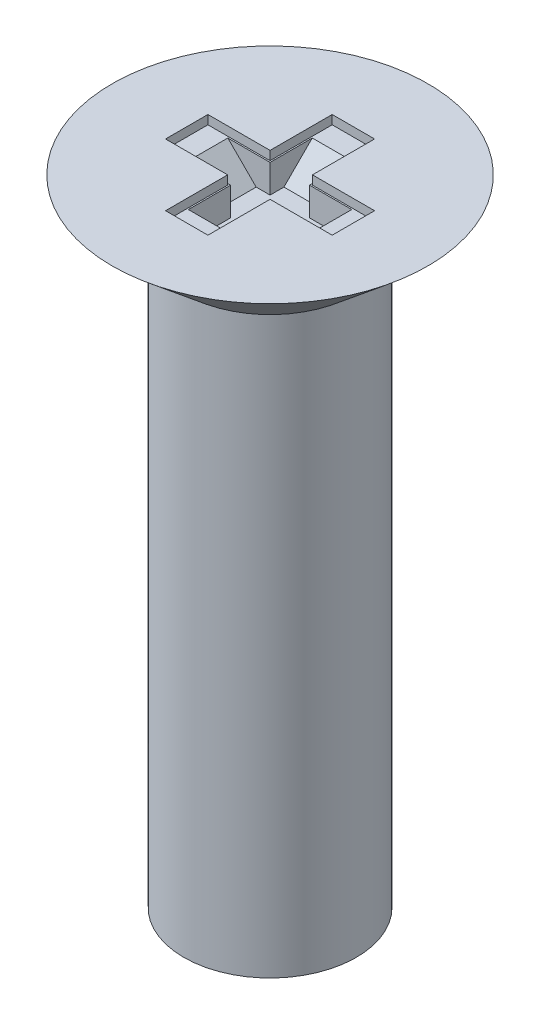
ISO-10303-21;
HEADER;
FILE_DESCRIPTION(('STEP AP214'),'2;1');
FILE_NAME('part.step','',(''),(''),'','','');
FILE_SCHEMA(('AUTOMOTIVE_DESIGN { 1 0 10303 214 1 1 1 1 }'));
ENDSEC;
DATA;
#1=APPLICATION_CONTEXT('core data for automotive mechanical design processes');
#2=APPLICATION_PROTOCOL_DEFINITION('international standard','automotive_design',2000,#1);
#3=PRODUCT_CONTEXT('',#1,'mechanical');
#4=PRODUCT('Part','Part','',(#3));
#5=PRODUCT_RELATED_PRODUCT_CATEGORY('part','',(#4));
#6=PRODUCT_DEFINITION_FORMATION('','',#4);
#7=PRODUCT_DEFINITION_CONTEXT('part definition',#1,'design');
#8=PRODUCT_DEFINITION('design','',#6,#7);
#9=PRODUCT_DEFINITION_SHAPE('','',#8);
#10=(LENGTH_UNIT() NAMED_UNIT(*) SI_UNIT(.MILLI.,.METRE.));
#11=(NAMED_UNIT(*) PLANE_ANGLE_UNIT() SI_UNIT($,.RADIAN.));
#12=(NAMED_UNIT(*) SI_UNIT($,.STERADIAN.) SOLID_ANGLE_UNIT());
#13=UNCERTAINTY_MEASURE_WITH_UNIT(LENGTH_MEASURE(1.E-05),#10,'distance_accuracy_value','');
#14=(GEOMETRIC_REPRESENTATION_CONTEXT(3) GLOBAL_UNCERTAINTY_ASSIGNED_CONTEXT((#13)) GLOBAL_UNIT_ASSIGNED_CONTEXT((#10,
#11,#12)) REPRESENTATION_CONTEXT('',''));
#15=CARTESIAN_POINT('',(0.,0.,0.));
#16=DIRECTION('',(0.,0.,1.));
#17=DIRECTION('',(1.,0.,0.));
#18=AXIS2_PLACEMENT_3D('',#15,#16,#17);
#19=CARTESIAN_POINT('',(-0.58416716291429,0.396610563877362,-0.3429));
#20=DIRECTION('',(0.,-1.,0.));
#21=DIRECTION('',(0.,0.,-1.));
#22=AXIS2_PLACEMENT_3D('',#19,#20,#21);
#23=PLANE('',#22);
#24=DIRECTION('',(1.,0.,0.));
#25=VECTOR('',#24,1.);
#26=CARTESIAN_POINT('',(-0.58416716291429,0.396610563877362,0.3429));
#27=LINE('',#26,#25);
#28=CARTESIAN_POINT('',(-0.584167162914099,0.396610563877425,0.3429));
#29=VERTEX_POINT('',#28);
#30=CARTESIAN_POINT('',(-0.3429,0.396610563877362,0.3429));
#31=VERTEX_POINT('',#30);
#32=EDGE_CURVE('E181',#29,#31,#27,.T.);
#33=ORIENTED_EDGE('',*,*,#32,.T.);
#34=DIRECTION('',(0.,0.,-1.));
#35=VECTOR('',#34,1.);
#36=CARTESIAN_POINT('',(-0.3429,0.396610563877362,0.));
#37=LINE('',#36,#35);
#38=CARTESIAN_POINT('',(-0.3429,0.396610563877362,0.584167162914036));
#39=VERTEX_POINT('',#38);
#40=EDGE_CURVE('E19',#39,#31,#37,.T.);
#41=ORIENTED_EDGE('',*,*,#40,.F.);
#42=DIRECTION('',(1.,0.,0.));
#43=VECTOR('',#42,1.);
#44=CARTESIAN_POINT('',(-0.3429,0.396610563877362,0.584167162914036));
#45=LINE('',#44,#43);
#46=CARTESIAN_POINT('',(0.3429,0.396610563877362,0.584167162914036));
#47=VERTEX_POINT('',#46);
#48=EDGE_CURVE('E178',#39,#47,#45,.T.);
#49=ORIENTED_EDGE('',*,*,#48,.T.);
#50=DIRECTION('',(0.,0.,-1.));
#51=VECTOR('',#50,1.);
#52=CARTESIAN_POINT('',(0.3429,0.396610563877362,-0.3429));
#53=LINE('',#52,#51);
#54=CARTESIAN_POINT('',(0.3429,0.396610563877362,0.3429));
#55=VERTEX_POINT('',#54);
#56=EDGE_CURVE('E193',#47,#55,#53,.T.);
#57=ORIENTED_EDGE('',*,*,#56,.T.);
#58=DIRECTION('',(1.,0.,0.));
#59=VECTOR('',#58,1.);
#60=CARTESIAN_POINT('',(-0.58416716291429,0.396610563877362,0.3429));
#61=LINE('',#60,#59);
#62=CARTESIAN_POINT('',(0.58416716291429,0.396610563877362,0.3429));
#63=VERTEX_POINT('',#62);
#64=EDGE_CURVE('E204',#55,#63,#61,.T.);
#65=ORIENTED_EDGE('',*,*,#64,.T.);
#66=DIRECTION('',(0.,0.,1.));
#67=VECTOR('',#66,1.);
#68=CARTESIAN_POINT('',(0.58416716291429,0.396610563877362,-0.3429));
#69=LINE('',#68,#67);
#70=CARTESIAN_POINT('',(0.58416716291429,0.396610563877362,-0.3429));
#71=VERTEX_POINT('',#70);
#72=EDGE_CURVE('E207',#63,#71,#69,.F.);
#73=ORIENTED_EDGE('',*,*,#72,.T.);
#74=DIRECTION('',(1.,0.,0.));
#75=VECTOR('',#74,1.);
#76=CARTESIAN_POINT('',(0.,0.396610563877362,-0.3429));
#77=LINE('',#76,#75);
#78=CARTESIAN_POINT('',(0.3429,0.396610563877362,-0.3429));
#79=VERTEX_POINT('',#78);
#80=EDGE_CURVE('E208',#79,#71,#77,.T.);
#81=ORIENTED_EDGE('',*,*,#80,.F.);
#82=DIRECTION('',(0.,0.,-1.));
#83=VECTOR('',#82,1.);
#84=CARTESIAN_POINT('',(0.3429,0.396610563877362,-0.3429));
#85=LINE('',#84,#83);
#86=CARTESIAN_POINT('',(0.3429,0.396610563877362,-0.584167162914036));
#87=VERTEX_POINT('',#86);
#88=EDGE_CURVE('E213',#79,#87,#85,.T.);
#89=ORIENTED_EDGE('',*,*,#88,.T.);
#90=DIRECTION('',(-1.,0.,0.));
#91=VECTOR('',#90,1.);
#92=CARTESIAN_POINT('',(-0.3429,0.396610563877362,-0.584167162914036));
#93=LINE('',#92,#91);
#94=CARTESIAN_POINT('',(-0.3429,0.396610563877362,-0.584167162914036));
#95=VERTEX_POINT('',#94);
#96=EDGE_CURVE('E215',#87,#95,#93,.T.);
#97=ORIENTED_EDGE('',*,*,#96,.T.);
#98=DIRECTION('',(0.,0.,-1.));
#99=VECTOR('',#98,1.);
#100=CARTESIAN_POINT('',(-0.3429,0.396610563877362,0.));
#101=LINE('',#100,#99);
#102=CARTESIAN_POINT('',(-0.3429,0.396610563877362,-0.3429));
#103=VERTEX_POINT('',#102);
#104=EDGE_CURVE('E221',#103,#95,#101,.T.);
#105=ORIENTED_EDGE('',*,*,#104,.F.);
#106=DIRECTION('',(1.,0.,0.));
#107=VECTOR('',#106,1.);
#108=CARTESIAN_POINT('',(0.,0.396610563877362,-0.3429));
#109=LINE('',#108,#107);
#110=CARTESIAN_POINT('',(-0.584167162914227,0.396610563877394,-0.3429));
#111=VERTEX_POINT('',#110);
#112=EDGE_CURVE('E223',#111,#103,#109,.T.);
#113=ORIENTED_EDGE('',*,*,#112,.F.);
#114=DIRECTION('',(0.,0.,1.));
#115=VECTOR('',#114,1.);
#116=CARTESIAN_POINT('',(-0.584167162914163,0.396610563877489,-0.3429));
#117=LINE('',#116,#115);
#118=EDGE_CURVE('E226',#111,#29,#117,.T.);
#119=ORIENTED_EDGE('',*,*,#118,.T.);
#120=EDGE_LOOP('',(#33,#41,#49,#57,#65,#73,#81,#89,#97,#105,#113,#119));
#121=FACE_BOUND('',#120,.T.);
#122=ADVANCED_FACE('F16',(#121),#23,.F.);
#123=CARTESIAN_POINT('',(-0.3429,0.,0.));
#124=DIRECTION('',(1.,0.,0.));
#125=DIRECTION('',(0.,0.,-1.));
#126=AXIS2_PLACEMENT_3D('',#123,#124,#125);
#127=PLANE('',#126);
#128=ORIENTED_EDGE('',*,*,#40,.T.);
#129=DIRECTION('',(0.,1.,0.));
#130=VECTOR('',#129,1.);
#131=CARTESIAN_POINT('',(-0.3429,0.,0.3429));
#132=LINE('',#131,#130);
#133=CARTESIAN_POINT('',(-0.3429,0.889,0.3429));
#134=VERTEX_POINT('',#133);
#135=EDGE_CURVE('E184',#31,#134,#132,.T.);
#136=ORIENTED_EDGE('',*,*,#135,.T.);
#137=DIRECTION('',(0.,0.,1.));
#138=VECTOR('',#137,1.);
#139=CARTESIAN_POINT('',(-0.3429,0.889,0.));
#140=LINE('',#139,#138);
#141=CARTESIAN_POINT('',(-0.3429,0.889,1.07655659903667));
#142=VERTEX_POINT('',#141);
#143=EDGE_CURVE('E189',#142,#134,#140,.F.);
#144=ORIENTED_EDGE('',*,*,#143,.F.);
#145=DIRECTION('',(0.,-0.707106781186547,-0.707106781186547));
#146=VECTOR('',#145,1.);
#147=CARTESIAN_POINT('',(-0.3429,0.889,1.07655659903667));
#148=LINE('',#147,#146);
#149=EDGE_CURVE('E186',#142,#39,#148,.T.);
#150=ORIENTED_EDGE('',*,*,#149,.T.);
#151=EDGE_LOOP('',(#128,#136,#144,#150));
#152=FACE_BOUND('',#151,.T.);
#153=ADVANCED_FACE('F187',(#152),#127,.T.);
#154=CARTESIAN_POINT('',(0.,0.,0.3429));
#155=DIRECTION('',(0.,0.,1.));
#156=DIRECTION('',(1.,0.,0.));
#157=AXIS2_PLACEMENT_3D('',#154,#155,#156);
#158=PLANE('',#157);
#159=DIRECTION('',(0.707106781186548,-0.707106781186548,0.));
#160=VECTOR('',#159,1.);
#161=CARTESIAN_POINT('',(-1.2319,1.04434340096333,0.3429));
#162=LINE('',#161,#160);
#163=CARTESIAN_POINT('',(-1.07655659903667,0.889,0.3429));
#164=VERTEX_POINT('',#163);
#165=EDGE_CURVE('E227',#29,#164,#162,.F.);
#166=ORIENTED_EDGE('',*,*,#165,.T.);
#167=DIRECTION('',(1.,0.,0.));
#168=VECTOR('',#167,1.);
#169=CARTESIAN_POINT('',(0.,0.889,0.3429));
#170=LINE('',#169,#168);
#171=EDGE_CURVE('E236',#134,#164,#170,.F.);
#172=ORIENTED_EDGE('',*,*,#171,.F.);
#173=ORIENTED_EDGE('',*,*,#135,.F.);
#174=ORIENTED_EDGE('',*,*,#32,.F.);
#175=EDGE_LOOP('',(#166,#172,#173,#174));
#176=FACE_BOUND('',#175,.T.);
#177=ADVANCED_FACE('F433',(#176),#158,.F.);
#178=CARTESIAN_POINT('',(-1.2319,1.04434340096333,-0.3429));
#179=DIRECTION('',(-0.707106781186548,-0.707106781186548,0.));
#180=DIRECTION('',(0.707106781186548,-0.707106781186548,0.));
#181=AXIS2_PLACEMENT_3D('',#178,#179,#180);
#182=PLANE('',#181);
#183=ORIENTED_EDGE('',*,*,#165,.F.);
#184=ORIENTED_EDGE('',*,*,#118,.F.);
#185=DIRECTION('',(0.707106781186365,-0.70710678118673,0.));
#186=VECTOR('',#185,1.);
#187=CARTESIAN_POINT('',(-1.07655659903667,0.889,-0.3429));
#188=LINE('',#187,#186);
#189=CARTESIAN_POINT('',(-1.07655659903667,0.889,-0.3429));
#190=VERTEX_POINT('',#189);
#191=EDGE_CURVE('E225',#190,#111,#188,.T.);
#192=ORIENTED_EDGE('',*,*,#191,.F.);
#193=DIRECTION('',(0.,0.,1.));
#194=VECTOR('',#193,1.);
#195=CARTESIAN_POINT('',(-1.07655659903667,0.889,0.));
#196=LINE('',#195,#194);
#197=EDGE_CURVE('E239',#164,#190,#196,.F.);
#198=ORIENTED_EDGE('',*,*,#197,.F.);
#199=EDGE_LOOP('',(#183,#184,#192,#198));
#200=FACE_BOUND('',#199,.T.);
#201=ADVANCED_FACE('F399',(#200),#182,.F.);
#202=CARTESIAN_POINT('',(0.,0.,-0.3429));
#203=DIRECTION('',(0.,0.,1.));
#204=DIRECTION('',(1.,0.,0.));
#205=AXIS2_PLACEMENT_3D('',#202,#203,#204);
#206=PLANE('',#205);
#207=ORIENTED_EDGE('',*,*,#112,.T.);
#208=DIRECTION('',(0.,1.,0.));
#209=VECTOR('',#208,1.);
#210=CARTESIAN_POINT('',(-0.3429,0.,-0.3429));
#211=LINE('',#210,#209);
#212=CARTESIAN_POINT('',(-0.3429,0.889,-0.3429));
#213=VERTEX_POINT('',#212);
#214=EDGE_CURVE('E220',#213,#103,#211,.F.);
#215=ORIENTED_EDGE('',*,*,#214,.F.);
#216=DIRECTION('',(1.,0.,0.));
#217=VECTOR('',#216,1.);
#218=CARTESIAN_POINT('',(0.,0.889,-0.3429));
#219=LINE('',#218,#217);
#220=EDGE_CURVE('E379',#190,#213,#219,.T.);
#221=ORIENTED_EDGE('',*,*,#220,.F.);
#222=ORIENTED_EDGE('',*,*,#191,.T.);
#223=EDGE_LOOP('',(#207,#215,#221,#222));
#224=FACE_BOUND('',#223,.T.);
#225=ADVANCED_FACE('F402',(#224),#206,.T.);
#226=CARTESIAN_POINT('',(-0.3429,0.,0.));
#227=DIRECTION('',(1.,0.,0.));
#228=DIRECTION('',(0.,0.,-1.));
#229=AXIS2_PLACEMENT_3D('',#226,#227,#228);
#230=PLANE('',#229);
#231=DIRECTION('',(0.,0.,1.));
#232=VECTOR('',#231,1.);
#233=CARTESIAN_POINT('',(-0.3429,0.889,0.));
#234=LINE('',#233,#232);
#235=CARTESIAN_POINT('',(-0.3429,0.889,-1.07655659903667));
#236=VERTEX_POINT('',#235);
#237=EDGE_CURVE('E376',#213,#236,#234,.F.);
#238=ORIENTED_EDGE('',*,*,#237,.F.);
#239=ORIENTED_EDGE('',*,*,#214,.T.);
#240=ORIENTED_EDGE('',*,*,#104,.T.);
#241=DIRECTION('',(0.,0.707106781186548,-0.707106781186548));
#242=VECTOR('',#241,1.);
#243=CARTESIAN_POINT('',(-0.3429,0.396637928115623,-0.584194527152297));
#244=LINE('',#243,#242);
#245=EDGE_CURVE('E218',#95,#236,#244,.T.);
#246=ORIENTED_EDGE('',*,*,#245,.T.);
#247=EDGE_LOOP('',(#238,#239,#240,#246));
#248=FACE_BOUND('',#247,.T.);
#249=ADVANCED_FACE('F405',(#248),#230,.T.);
#250=CARTESIAN_POINT('',(-0.3429,0.396643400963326,-0.5842));
#251=DIRECTION('',(0.,-0.707106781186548,-0.707106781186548));
#252=DIRECTION('',(0.,0.707106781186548,-0.707106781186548));
#253=AXIS2_PLACEMENT_3D('',#250,#251,#252);
#254=PLANE('',#253);
#255=DIRECTION('',(0.,0.707106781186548,-0.707106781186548));
#256=VECTOR('',#255,1.);
#257=CARTESIAN_POINT('',(0.3429,0.396643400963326,-0.5842));
#258=LINE('',#257,#256);
#259=CARTESIAN_POINT('',(0.3429,0.889,-1.07655659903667));
#260=VERTEX_POINT('',#259);
#261=EDGE_CURVE('E211',#87,#260,#258,.T.);
#262=ORIENTED_EDGE('',*,*,#261,.T.);
#263=DIRECTION('',(1.,0.,0.));
#264=VECTOR('',#263,1.);
#265=CARTESIAN_POINT('',(0.,0.889,-1.07655659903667));
#266=LINE('',#265,#264);
#267=EDGE_CURVE('E373',#236,#260,#266,.T.);
#268=ORIENTED_EDGE('',*,*,#267,.F.);
#269=ORIENTED_EDGE('',*,*,#245,.F.);
#270=ORIENTED_EDGE('',*,*,#96,.F.);
#271=EDGE_LOOP('',(#262,#268,#269,#270));
#272=FACE_BOUND('',#271,.T.);
#273=ADVANCED_FACE('F410',(#272),#254,.F.);
#274=CARTESIAN_POINT('',(0.3429,0.,0.));
#275=DIRECTION('',(1.,0.,0.));
#276=DIRECTION('',(0.,0.,-1.));
#277=AXIS2_PLACEMENT_3D('',#274,#275,#276);
#278=PLANE('',#277);
#279=ORIENTED_EDGE('',*,*,#261,.F.);
#280=ORIENTED_EDGE('',*,*,#88,.F.);
#281=DIRECTION('',(0.,1.,0.));
#282=VECTOR('',#281,1.);
#283=CARTESIAN_POINT('',(0.3429,0.,-0.3429));
#284=LINE('',#283,#282);
#285=CARTESIAN_POINT('',(0.3429,0.889,-0.3429));
#286=VERTEX_POINT('',#285);
#287=EDGE_CURVE('E210',#286,#79,#284,.F.);
#288=ORIENTED_EDGE('',*,*,#287,.F.);
#289=DIRECTION('',(0.,0.,1.));
#290=VECTOR('',#289,1.);
#291=CARTESIAN_POINT('',(0.3429,0.889,0.));
#292=LINE('',#291,#290);
#293=EDGE_CURVE('E366',#260,#286,#292,.T.);
#294=ORIENTED_EDGE('',*,*,#293,.F.);
#295=EDGE_LOOP('',(#279,#280,#288,#294));
#296=FACE_BOUND('',#295,.T.);
#297=ADVANCED_FACE('F415',(#296),#278,.F.);
#298=CARTESIAN_POINT('',(0.,0.,-0.3429));
#299=DIRECTION('',(0.,0.,1.));
#300=DIRECTION('',(1.,0.,0.));
#301=AXIS2_PLACEMENT_3D('',#298,#299,#300);
#302=PLANE('',#301);
#303=DIRECTION('',(1.,0.,0.));
#304=VECTOR('',#303,1.);
#305=CARTESIAN_POINT('',(0.,0.889,-0.3429));
#306=LINE('',#305,#304);
#307=CARTESIAN_POINT('',(1.0765565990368,0.888999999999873,-0.3429));
#308=VERTEX_POINT('',#307);
#309=EDGE_CURVE('E361',#286,#308,#306,.T.);
#310=ORIENTED_EDGE('',*,*,#309,.F.);
#311=ORIENTED_EDGE('',*,*,#287,.T.);
#312=ORIENTED_EDGE('',*,*,#80,.T.);
#313=DIRECTION('',(0.707106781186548,0.707106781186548,0.));
#314=VECTOR('',#313,1.);
#315=CARTESIAN_POINT('',(0.58416716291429,0.396610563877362,-0.3429));
#316=LINE('',#315,#314);
#317=EDGE_CURVE('E354',#71,#308,#316,.T.);
#318=ORIENTED_EDGE('',*,*,#317,.T.);
#319=EDGE_LOOP('',(#310,#311,#312,#318));
#320=FACE_BOUND('',#319,.T.);
#321=ADVANCED_FACE('F418',(#320),#302,.T.);
#322=CARTESIAN_POINT('',(0.58416716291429,0.396610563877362,-0.3429));
#323=DIRECTION('',(0.707106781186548,-0.707106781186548,0.));
#324=DIRECTION('',(0.707106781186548,0.707106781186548,0.));
#325=AXIS2_PLACEMENT_3D('',#322,#323,#324);
#326=PLANE('',#325);
#327=DIRECTION('',(0.707106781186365,0.70710678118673,0.));
#328=VECTOR('',#327,1.);
#329=CARTESIAN_POINT('',(0.58416716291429,0.396610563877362,0.3429));
#330=LINE('',#329,#328);
#331=CARTESIAN_POINT('',(1.07655659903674,0.888999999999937,0.3429));
#332=VERTEX_POINT('',#331);
#333=EDGE_CURVE('E206',#63,#332,#330,.T.);
#334=ORIENTED_EDGE('',*,*,#333,.T.);
#335=DIRECTION('',(0.,0.,1.));
#336=VECTOR('',#335,1.);
#337=CARTESIAN_POINT('',(1.07655659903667,0.889,0.));
#338=LINE('',#337,#336);
#339=EDGE_CURVE('E349',#308,#332,#338,.T.);
#340=ORIENTED_EDGE('',*,*,#339,.F.);
#341=ORIENTED_EDGE('',*,*,#317,.F.);
#342=ORIENTED_EDGE('',*,*,#72,.F.);
#343=EDGE_LOOP('',(#334,#340,#341,#342));
#344=FACE_BOUND('',#343,.T.);
#345=ADVANCED_FACE('F423',(#344),#326,.F.);
#346=CARTESIAN_POINT('',(0.,0.,0.3429));
#347=DIRECTION('',(0.,0.,1.));
#348=DIRECTION('',(1.,0.,0.));
#349=AXIS2_PLACEMENT_3D('',#346,#347,#348);
#350=PLANE('',#349);
#351=ORIENTED_EDGE('',*,*,#333,.F.);
#352=ORIENTED_EDGE('',*,*,#64,.F.);
#353=DIRECTION('',(0.,1.,0.));
#354=VECTOR('',#353,1.);
#355=CARTESIAN_POINT('',(0.3429,0.,0.3429));
#356=LINE('',#355,#354);
#357=CARTESIAN_POINT('',(0.3429,0.889,0.3429));
#358=VERTEX_POINT('',#357);
#359=EDGE_CURVE('E203',#55,#358,#356,.T.);
#360=ORIENTED_EDGE('',*,*,#359,.T.);
#361=DIRECTION('',(1.,0.,0.));
#362=VECTOR('',#361,1.);
#363=CARTESIAN_POINT('',(0.,0.889,0.3429));
#364=LINE('',#363,#362);
#365=EDGE_CURVE('E338',#332,#358,#364,.F.);
#366=ORIENTED_EDGE('',*,*,#365,.F.);
#367=EDGE_LOOP('',(#351,#352,#360,#366));
#368=FACE_BOUND('',#367,.T.);
#369=ADVANCED_FACE('F427',(#368),#350,.F.);
#370=CARTESIAN_POINT('',(0.3429,0.,0.));
#371=DIRECTION('',(1.,0.,0.));
#372=DIRECTION('',(0.,0.,-1.));
#373=AXIS2_PLACEMENT_3D('',#370,#371,#372);
#374=PLANE('',#373);
#375=DIRECTION('',(0.,0.707106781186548,0.707106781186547));
#376=VECTOR('',#375,1.);
#377=CARTESIAN_POINT('',(0.3429,0.396637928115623,0.584194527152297));
#378=LINE('',#377,#376);
#379=CARTESIAN_POINT('',(0.3429,0.889,1.07655659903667));
#380=VERTEX_POINT('',#379);
#381=EDGE_CURVE('E197',#47,#380,#378,.T.);
#382=ORIENTED_EDGE('',*,*,#381,.T.);
#383=DIRECTION('',(0.,0.,1.));
#384=VECTOR('',#383,1.);
#385=CARTESIAN_POINT('',(0.3429,0.889,0.));
#386=LINE('',#385,#384);
#387=EDGE_CURVE('E335',#358,#380,#386,.T.);
#388=ORIENTED_EDGE('',*,*,#387,.F.);
#389=ORIENTED_EDGE('',*,*,#359,.F.);
#390=ORIENTED_EDGE('',*,*,#56,.F.);
#391=EDGE_LOOP('',(#382,#388,#389,#390));
#392=FACE_BOUND('',#391,.T.);
#393=ADVANCED_FACE('F431',(#392),#374,.F.);
#394=CARTESIAN_POINT('',(-0.3429,1.04434340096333,1.2319));
#395=DIRECTION('',(0.,-0.707106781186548,0.707106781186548));
#396=DIRECTION('',(0.,-0.707106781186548,-0.707106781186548));
#397=AXIS2_PLACEMENT_3D('',#394,#395,#396);
#398=PLANE('',#397);
#399=ORIENTED_EDGE('',*,*,#381,.F.);
#400=ORIENTED_EDGE('',*,*,#48,.F.);
#401=ORIENTED_EDGE('',*,*,#149,.F.);
#402=DIRECTION('',(1.,0.,0.));
#403=VECTOR('',#402,1.);
#404=CARTESIAN_POINT('',(0.,0.889,1.07655659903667));
#405=LINE('',#404,#403);
#406=EDGE_CURVE('E333',#380,#142,#405,.F.);
#407=ORIENTED_EDGE('',*,*,#406,.F.);
#408=EDGE_LOOP('',(#399,#400,#401,#407));
#409=FACE_BOUND('',#408,.T.);
#410=ADVANCED_FACE('F196',(#409),#398,.F.);
#411=CARTESIAN_POINT('',(0.,0.889,0.));
#412=DIRECTION('',(0.,1.,0.));
#413=DIRECTION('',(0.,0.,1.));
#414=AXIS2_PLACEMENT_3D('',#411,#412,#413);
#415=PLANE('',#414);
#416=ORIENTED_EDGE('',*,*,#387,.T.);
#417=ORIENTED_EDGE('',*,*,#406,.T.);
#418=ORIENTED_EDGE('',*,*,#143,.T.);
#419=ORIENTED_EDGE('',*,*,#171,.T.);
#420=ORIENTED_EDGE('',*,*,#197,.T.);
#421=ORIENTED_EDGE('',*,*,#220,.T.);
#422=ORIENTED_EDGE('',*,*,#237,.T.);
#423=ORIENTED_EDGE('',*,*,#267,.T.);
#424=ORIENTED_EDGE('',*,*,#293,.T.);
#425=ORIENTED_EDGE('',*,*,#309,.T.);
#426=ORIENTED_EDGE('',*,*,#339,.T.);
#427=ORIENTED_EDGE('',*,*,#365,.T.);
#428=EDGE_LOOP('',(#416,#417,#418,#419,#420,#421,#422,#423,#424,#425,#426,#427));
#429=FACE_BOUND('',#428,.T.);
#430=DIRECTION('',(-1.,0.,0.));
#431=VECTOR('',#430,1.);
#432=CARTESIAN_POINT('',(0.3683,0.889,-1.4478));
#433=LINE('',#432,#431);
#434=CARTESIAN_POINT('',(0.3683,0.889,-1.4478));
#435=VERTEX_POINT('',#434);
#436=CARTESIAN_POINT('',(-0.3683,0.889,-1.4478));
#437=VERTEX_POINT('',#436);
#438=EDGE_CURVE('E331',#435,#437,#433,.T.);
#439=ORIENTED_EDGE('',*,*,#438,.T.);
#440=DIRECTION('',(0.,0.,1.));
#441=VECTOR('',#440,1.);
#442=CARTESIAN_POINT('',(-0.3683,0.889,-1.4478));
#443=LINE('',#442,#441);
#444=CARTESIAN_POINT('',(-0.3683,0.889,-0.3683));
#445=VERTEX_POINT('',#444);
#446=EDGE_CURVE('E286',#437,#445,#443,.T.);
#447=ORIENTED_EDGE('',*,*,#446,.T.);
#448=DIRECTION('',(-1.,0.,0.));
#449=VECTOR('',#448,1.);
#450=CARTESIAN_POINT('',(-0.3683,0.889,-0.3683));
#451=LINE('',#450,#449);
#452=CARTESIAN_POINT('',(-1.4478,0.889,-0.3683));
#453=VERTEX_POINT('',#452);
#454=EDGE_CURVE('E293',#445,#453,#451,.T.);
#455=ORIENTED_EDGE('',*,*,#454,.T.);
#456=DIRECTION('',(0.,0.,1.));
#457=VECTOR('',#456,1.);
#458=CARTESIAN_POINT('',(-1.4478,0.889,-0.3683));
#459=LINE('',#458,#457);
#460=CARTESIAN_POINT('',(-1.4478,0.889,0.3683));
#461=VERTEX_POINT('',#460);
#462=EDGE_CURVE('E297',#453,#461,#459,.T.);
#463=ORIENTED_EDGE('',*,*,#462,.T.);
#464=DIRECTION('',(1.,0.,0.));
#465=VECTOR('',#464,1.);
#466=CARTESIAN_POINT('',(-1.4478,0.889,0.3683));
#467=LINE('',#466,#465);
#468=CARTESIAN_POINT('',(-0.3683,0.889,0.3683));
#469=VERTEX_POINT('',#468);
#470=EDGE_CURVE('E301',#461,#469,#467,.T.);
#471=ORIENTED_EDGE('',*,*,#470,.T.);
#472=DIRECTION('',(0.,0.,1.));
#473=VECTOR('',#472,1.);
#474=CARTESIAN_POINT('',(-0.3683,0.889,0.3683));
#475=LINE('',#474,#473);
#476=CARTESIAN_POINT('',(-0.3683,0.889,1.4478));
#477=VERTEX_POINT('',#476);
#478=EDGE_CURVE('E305',#469,#477,#475,.T.);
#479=ORIENTED_EDGE('',*,*,#478,.T.);
#480=DIRECTION('',(1.,0.,0.));
#481=VECTOR('',#480,1.);
#482=CARTESIAN_POINT('',(-0.3683,0.889,1.4478));
#483=LINE('',#482,#481);
#484=CARTESIAN_POINT('',(0.3683,0.889,1.4478));
#485=VERTEX_POINT('',#484);
#486=EDGE_CURVE('E309',#477,#485,#483,.T.);
#487=ORIENTED_EDGE('',*,*,#486,.T.);
#488=DIRECTION('',(0.,0.,-1.));
#489=VECTOR('',#488,1.);
#490=CARTESIAN_POINT('',(0.3683,0.889,1.4478));
#491=LINE('',#490,#489);
#492=CARTESIAN_POINT('',(0.3683,0.889,0.3683));
#493=VERTEX_POINT('',#492);
#494=EDGE_CURVE('E313',#485,#493,#491,.T.);
#495=ORIENTED_EDGE('',*,*,#494,.T.);
#496=DIRECTION('',(1.,0.,0.));
#497=VECTOR('',#496,1.);
#498=CARTESIAN_POINT('',(0.3683,0.889,0.3683));
#499=LINE('',#498,#497);
#500=CARTESIAN_POINT('',(1.4478,0.889,0.3683));
#501=VERTEX_POINT('',#500);
#502=EDGE_CURVE('E317',#493,#501,#499,.T.);
#503=ORIENTED_EDGE('',*,*,#502,.T.);
#504=DIRECTION('',(0.,0.,-1.));
#505=VECTOR('',#504,1.);
#506=CARTESIAN_POINT('',(1.4478,0.889,0.3683));
#507=LINE('',#506,#505);
#508=CARTESIAN_POINT('',(1.4478,0.889,-0.3683));
#509=VERTEX_POINT('',#508);
#510=EDGE_CURVE('E321',#501,#509,#507,.T.);
#511=ORIENTED_EDGE('',*,*,#510,.T.);
#512=DIRECTION('',(-1.,0.,0.));
#513=VECTOR('',#512,1.);
#514=CARTESIAN_POINT('',(1.4478,0.889,-0.3683));
#515=LINE('',#514,#513);
#516=CARTESIAN_POINT('',(0.3683,0.889,-0.3683));
#517=VERTEX_POINT('',#516);
#518=EDGE_CURVE('E325',#509,#517,#515,.T.);
#519=ORIENTED_EDGE('',*,*,#518,.T.);
#520=DIRECTION('',(0.,0.,-1.));
#521=VECTOR('',#520,1.);
#522=CARTESIAN_POINT('',(0.3683,0.889,-0.3683));
#523=LINE('',#522,#521);
#524=EDGE_CURVE('E329',#517,#435,#523,.T.);
#525=ORIENTED_EDGE('',*,*,#524,.T.);
#526=EDGE_LOOP('',(#439,#447,#455,#463,#471,#479,#487,#495,#503,#511,#519,#525));
#527=FACE_BOUND('',#526,.T.);
#528=ADVANCED_FACE('F394',(#429,#527),#415,.T.);
#529=CARTESIAN_POINT('',(0.3683,2.921,-1.4478));
#530=DIRECTION('',(0.,0.,-1.));
#531=DIRECTION('',(-1.,0.,0.));
#532=AXIS2_PLACEMENT_3D('',#529,#530,#531);
#533=PLANE('',#532);
#534=ORIENTED_EDGE('',*,*,#438,.F.);
#535=DIRECTION('',(0.,1.,0.));
#536=VECTOR('',#535,1.);
#537=CARTESIAN_POINT('',(0.3683,2.921,-1.4478));
#538=LINE('',#537,#536);
#539=CARTESIAN_POINT('',(0.3683,1.04434340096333,-1.4478));
#540=VERTEX_POINT('',#539);
#541=EDGE_CURVE('E327',#435,#540,#538,.T.);
#542=ORIENTED_EDGE('',*,*,#541,.T.);
#543=DIRECTION('',(1.,0.,0.));
#544=VECTOR('',#543,1.);
#545=CARTESIAN_POINT('',(0.,1.04434340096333,-1.4478));
#546=LINE('',#545,#544);
#547=CARTESIAN_POINT('',(-0.3683,1.04434340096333,-1.4478));
#548=VERTEX_POINT('',#547);
#549=EDGE_CURVE('E283',#548,#540,#546,.T.);
#550=ORIENTED_EDGE('',*,*,#549,.F.);
#551=DIRECTION('',(0.,1.,0.));
#552=VECTOR('',#551,1.);
#553=CARTESIAN_POINT('',(-0.3683,2.921,-1.4478));
#554=LINE('',#553,#552);
#555=EDGE_CURVE('E288',#548,#437,#554,.F.);
#556=ORIENTED_EDGE('',*,*,#555,.T.);
#557=EDGE_LOOP('',(#534,#542,#550,#556));
#558=FACE_BOUND('',#557,.T.);
#559=ADVANCED_FACE('F502',(#558),#533,.F.);
#560=CARTESIAN_POINT('',(0.3683,2.921,-0.3683));
#561=DIRECTION('',(1.,0.,0.));
#562=DIRECTION('',(0.,0.,-1.));
#563=AXIS2_PLACEMENT_3D('',#560,#561,#562);
#564=PLANE('',#563);
#565=ORIENTED_EDGE('',*,*,#524,.F.);
#566=DIRECTION('',(0.,1.,0.));
#567=VECTOR('',#566,1.);
#568=CARTESIAN_POINT('',(0.3683,2.921,-0.3683));
#569=LINE('',#568,#567);
#570=CARTESIAN_POINT('',(0.3683,1.04434340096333,-0.3683));
#571=VERTEX_POINT('',#570);
#572=EDGE_CURVE('E323',#517,#571,#569,.T.);
#573=ORIENTED_EDGE('',*,*,#572,.T.);
#574=DIRECTION('',(0.,0.,1.));
#575=VECTOR('',#574,1.);
#576=CARTESIAN_POINT('',(0.3683,1.04434340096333,0.));
#577=LINE('',#576,#575);
#578=EDGE_CURVE('E280',#540,#571,#577,.T.);
#579=ORIENTED_EDGE('',*,*,#578,.F.);
#580=ORIENTED_EDGE('',*,*,#541,.F.);
#581=EDGE_LOOP('',(#565,#573,#579,#580));
#582=FACE_BOUND('',#581,.T.);
#583=ADVANCED_FACE('F498',(#582),#564,.F.);
#584=CARTESIAN_POINT('',(1.4478,2.921,-0.3683));
#585=DIRECTION('',(0.,0.,-1.));
#586=DIRECTION('',(-1.,0.,0.));
#587=AXIS2_PLACEMENT_3D('',#584,#585,#586);
#588=PLANE('',#587);
#589=ORIENTED_EDGE('',*,*,#518,.F.);
#590=DIRECTION('',(0.,1.,0.));
#591=VECTOR('',#590,1.);
#592=CARTESIAN_POINT('',(1.4478,2.921,-0.3683));
#593=LINE('',#592,#591);
#594=CARTESIAN_POINT('',(1.4478,1.04434340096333,-0.3683));
#595=VERTEX_POINT('',#594);
#596=EDGE_CURVE('E319',#509,#595,#593,.T.);
#597=ORIENTED_EDGE('',*,*,#596,.T.);
#598=DIRECTION('',(1.,0.,0.));
#599=VECTOR('',#598,1.);
#600=CARTESIAN_POINT('',(0.,1.04434340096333,-0.3683));
#601=LINE('',#600,#599);
#602=EDGE_CURVE('E277',#571,#595,#601,.T.);
#603=ORIENTED_EDGE('',*,*,#602,.F.);
#604=ORIENTED_EDGE('',*,*,#572,.F.);
#605=EDGE_LOOP('',(#589,#597,#603,#604));
#606=FACE_BOUND('',#605,.T.);
#607=ADVANCED_FACE('F494',(#606),#588,.F.);
#608=CARTESIAN_POINT('',(1.4478,2.921,0.3683));
#609=DIRECTION('',(1.,0.,0.));
#610=DIRECTION('',(0.,0.,-1.));
#611=AXIS2_PLACEMENT_3D('',#608,#609,#610);
#612=PLANE('',#611);
#613=ORIENTED_EDGE('',*,*,#510,.F.);
#614=DIRECTION('',(0.,1.,0.));
#615=VECTOR('',#614,1.);
#616=CARTESIAN_POINT('',(1.4478,2.921,0.3683));
#617=LINE('',#616,#615);
#618=CARTESIAN_POINT('',(1.4478,1.04434340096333,0.3683));
#619=VERTEX_POINT('',#618);
#620=EDGE_CURVE('E315',#501,#619,#617,.T.);
#621=ORIENTED_EDGE('',*,*,#620,.T.);
#622=DIRECTION('',(0.,0.,1.));
#623=VECTOR('',#622,1.);
#624=CARTESIAN_POINT('',(1.4478,1.04434340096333,0.));
#625=LINE('',#624,#623);
#626=EDGE_CURVE('E274',#595,#619,#625,.T.);
#627=ORIENTED_EDGE('',*,*,#626,.F.);
#628=ORIENTED_EDGE('',*,*,#596,.F.);
#629=EDGE_LOOP('',(#613,#621,#627,#628));
#630=FACE_BOUND('',#629,.T.);
#631=ADVANCED_FACE('F490',(#630),#612,.F.);
#632=CARTESIAN_POINT('',(0.3683,2.921,0.3683));
#633=DIRECTION('',(0.,0.,1.));
#634=DIRECTION('',(1.,0.,0.));
#635=AXIS2_PLACEMENT_3D('',#632,#633,#634);
#636=PLANE('',#635);
#637=ORIENTED_EDGE('',*,*,#502,.F.);
#638=DIRECTION('',(0.,1.,0.));
#639=VECTOR('',#638,1.);
#640=CARTESIAN_POINT('',(0.3683,2.921,0.3683));
#641=LINE('',#640,#639);
#642=CARTESIAN_POINT('',(0.3683,1.04434340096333,0.3683));
#643=VERTEX_POINT('',#642);
#644=EDGE_CURVE('E311',#493,#643,#641,.T.);
#645=ORIENTED_EDGE('',*,*,#644,.T.);
#646=DIRECTION('',(1.,0.,0.));
#647=VECTOR('',#646,1.);
#648=CARTESIAN_POINT('',(0.,1.04434340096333,0.3683));
#649=LINE('',#648,#647);
#650=EDGE_CURVE('E271',#619,#643,#649,.F.);
#651=ORIENTED_EDGE('',*,*,#650,.F.);
#652=ORIENTED_EDGE('',*,*,#620,.F.);
#653=EDGE_LOOP('',(#637,#645,#651,#652));
#654=FACE_BOUND('',#653,.T.);
#655=ADVANCED_FACE('F486',(#654),#636,.F.);
#656=CARTESIAN_POINT('',(0.3683,2.921,1.4478));
#657=DIRECTION('',(1.,0.,0.));
#658=DIRECTION('',(0.,0.,-1.));
#659=AXIS2_PLACEMENT_3D('',#656,#657,#658);
#660=PLANE('',#659);
#661=ORIENTED_EDGE('',*,*,#494,.F.);
#662=DIRECTION('',(0.,1.,0.));
#663=VECTOR('',#662,1.);
#664=CARTESIAN_POINT('',(0.3683,2.921,1.4478));
#665=LINE('',#664,#663);
#666=CARTESIAN_POINT('',(0.3683,1.04434340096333,1.4478));
#667=VERTEX_POINT('',#666);
#668=EDGE_CURVE('E307',#485,#667,#665,.T.);
#669=ORIENTED_EDGE('',*,*,#668,.T.);
#670=DIRECTION('',(0.,0.,1.));
#671=VECTOR('',#670,1.);
#672=CARTESIAN_POINT('',(0.3683,1.04434340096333,0.));
#673=LINE('',#672,#671);
#674=EDGE_CURVE('E268',#643,#667,#673,.T.);
#675=ORIENTED_EDGE('',*,*,#674,.F.);
#676=ORIENTED_EDGE('',*,*,#644,.F.);
#677=EDGE_LOOP('',(#661,#669,#675,#676));
#678=FACE_BOUND('',#677,.T.);
#679=ADVANCED_FACE('F482',(#678),#660,.F.);
#680=CARTESIAN_POINT('',(-0.3683,2.921,1.4478));
#681=DIRECTION('',(0.,0.,1.));
#682=DIRECTION('',(1.,0.,0.));
#683=AXIS2_PLACEMENT_3D('',#680,#681,#682);
#684=PLANE('',#683);
#685=ORIENTED_EDGE('',*,*,#486,.F.);
#686=DIRECTION('',(0.,1.,0.));
#687=VECTOR('',#686,1.);
#688=CARTESIAN_POINT('',(-0.3683,2.921,1.4478));
#689=LINE('',#688,#687);
#690=CARTESIAN_POINT('',(-0.3683,1.04434340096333,1.4478));
#691=VERTEX_POINT('',#690);
#692=EDGE_CURVE('E303',#477,#691,#689,.T.);
#693=ORIENTED_EDGE('',*,*,#692,.T.);
#694=DIRECTION('',(1.,0.,0.));
#695=VECTOR('',#694,1.);
#696=CARTESIAN_POINT('',(0.,1.04434340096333,1.4478));
#697=LINE('',#696,#695);
#698=EDGE_CURVE('E265',#667,#691,#697,.F.);
#699=ORIENTED_EDGE('',*,*,#698,.F.);
#700=ORIENTED_EDGE('',*,*,#668,.F.);
#701=EDGE_LOOP('',(#685,#693,#699,#700));
#702=FACE_BOUND('',#701,.T.);
#703=ADVANCED_FACE('F478',(#702),#684,.F.);
#704=CARTESIAN_POINT('',(-0.3683,2.921,0.3683));
#705=DIRECTION('',(-1.,0.,0.));
#706=DIRECTION('',(0.,0.,1.));
#707=AXIS2_PLACEMENT_3D('',#704,#705,#706);
#708=PLANE('',#707);
#709=ORIENTED_EDGE('',*,*,#478,.F.);
#710=DIRECTION('',(0.,1.,0.));
#711=VECTOR('',#710,1.);
#712=CARTESIAN_POINT('',(-0.3683,2.921,0.3683));
#713=LINE('',#712,#711);
#714=CARTESIAN_POINT('',(-0.3683,1.04434340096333,0.3683));
#715=VERTEX_POINT('',#714);
#716=EDGE_CURVE('E299',#469,#715,#713,.T.);
#717=ORIENTED_EDGE('',*,*,#716,.T.);
#718=DIRECTION('',(0.,0.,1.));
#719=VECTOR('',#718,1.);
#720=CARTESIAN_POINT('',(-0.3683,1.04434340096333,0.));
#721=LINE('',#720,#719);
#722=EDGE_CURVE('E262',#691,#715,#721,.F.);
#723=ORIENTED_EDGE('',*,*,#722,.F.);
#724=ORIENTED_EDGE('',*,*,#692,.F.);
#725=EDGE_LOOP('',(#709,#717,#723,#724));
#726=FACE_BOUND('',#725,.T.);
#727=ADVANCED_FACE('F474',(#726),#708,.F.);
#728=CARTESIAN_POINT('',(-1.4478,2.921,0.3683));
#729=DIRECTION('',(0.,0.,1.));
#730=DIRECTION('',(1.,0.,0.));
#731=AXIS2_PLACEMENT_3D('',#728,#729,#730);
#732=PLANE('',#731);
#733=ORIENTED_EDGE('',*,*,#470,.F.);
#734=DIRECTION('',(0.,1.,0.));
#735=VECTOR('',#734,1.);
#736=CARTESIAN_POINT('',(-1.4478,2.921,0.3683));
#737=LINE('',#736,#735);
#738=CARTESIAN_POINT('',(-1.4478,1.04434340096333,0.3683));
#739=VERTEX_POINT('',#738);
#740=EDGE_CURVE('E295',#461,#739,#737,.T.);
#741=ORIENTED_EDGE('',*,*,#740,.T.);
#742=DIRECTION('',(1.,0.,0.));
#743=VECTOR('',#742,1.);
#744=CARTESIAN_POINT('',(0.,1.04434340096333,0.3683));
#745=LINE('',#744,#743);
#746=EDGE_CURVE('E259',#715,#739,#745,.F.);
#747=ORIENTED_EDGE('',*,*,#746,.F.);
#748=ORIENTED_EDGE('',*,*,#716,.F.);
#749=EDGE_LOOP('',(#733,#741,#747,#748));
#750=FACE_BOUND('',#749,.T.);
#751=ADVANCED_FACE('F470',(#750),#732,.F.);
#752=CARTESIAN_POINT('',(-1.4478,2.921,-0.3683));
#753=DIRECTION('',(-1.,0.,0.));
#754=DIRECTION('',(0.,0.,1.));
#755=AXIS2_PLACEMENT_3D('',#752,#753,#754);
#756=PLANE('',#755);
#757=ORIENTED_EDGE('',*,*,#462,.F.);
#758=DIRECTION('',(0.,1.,0.));
#759=VECTOR('',#758,1.);
#760=CARTESIAN_POINT('',(-1.4478,2.921,-0.3683));
#761=LINE('',#760,#759);
#762=CARTESIAN_POINT('',(-1.4478,1.04434340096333,-0.3683));
#763=VERTEX_POINT('',#762);
#764=EDGE_CURVE('E291',#453,#763,#761,.T.);
#765=ORIENTED_EDGE('',*,*,#764,.T.);
#766=DIRECTION('',(0.,0.,1.));
#767=VECTOR('',#766,1.);
#768=CARTESIAN_POINT('',(-1.4478,1.04434340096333,0.));
#769=LINE('',#768,#767);
#770=EDGE_CURVE('E254',#739,#763,#769,.F.);
#771=ORIENTED_EDGE('',*,*,#770,.F.);
#772=ORIENTED_EDGE('',*,*,#740,.F.);
#773=EDGE_LOOP('',(#757,#765,#771,#772));
#774=FACE_BOUND('',#773,.T.);
#775=ADVANCED_FACE('F467',(#774),#756,.F.);
#776=CARTESIAN_POINT('',(-0.3683,2.921,-0.3683));
#777=DIRECTION('',(0.,0.,-1.));
#778=DIRECTION('',(-1.,0.,0.));
#779=AXIS2_PLACEMENT_3D('',#776,#777,#778);
#780=PLANE('',#779);
#781=ORIENTED_EDGE('',*,*,#454,.F.);
#782=DIRECTION('',(0.,1.,0.));
#783=VECTOR('',#782,1.);
#784=CARTESIAN_POINT('',(-0.3683,2.921,-0.3683));
#785=LINE('',#784,#783);
#786=CARTESIAN_POINT('',(-0.3683,1.04434340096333,-0.3683));
#787=VERTEX_POINT('',#786);
#788=EDGE_CURVE('E34',#445,#787,#785,.T.);
#789=ORIENTED_EDGE('',*,*,#788,.T.);
#790=DIRECTION('',(1.,0.,0.));
#791=VECTOR('',#790,1.);
#792=CARTESIAN_POINT('',(0.,1.04434340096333,-0.3683));
#793=LINE('',#792,#791);
#794=EDGE_CURVE('E249',#763,#787,#793,.T.);
#795=ORIENTED_EDGE('',*,*,#794,.F.);
#796=ORIENTED_EDGE('',*,*,#764,.F.);
#797=EDGE_LOOP('',(#781,#789,#795,#796));
#798=FACE_BOUND('',#797,.T.);
#799=ADVANCED_FACE('F463',(#798),#780,.F.);
#800=CARTESIAN_POINT('',(-0.3683,2.921,-1.4478));
#801=DIRECTION('',(-1.,0.,0.));
#802=DIRECTION('',(0.,0.,1.));
#803=AXIS2_PLACEMENT_3D('',#800,#801,#802);
#804=PLANE('',#803);
#805=ORIENTED_EDGE('',*,*,#446,.F.);
#806=ORIENTED_EDGE('',*,*,#555,.F.);
#807=DIRECTION('',(0.,0.,1.));
#808=VECTOR('',#807,1.);
#809=CARTESIAN_POINT('',(-0.3683,1.04434340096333,0.));
#810=LINE('',#809,#808);
#811=EDGE_CURVE('E245',#787,#548,#810,.F.);
#812=ORIENTED_EDGE('',*,*,#811,.F.);
#813=ORIENTED_EDGE('',*,*,#788,.F.);
#814=EDGE_LOOP('',(#805,#806,#812,#813));
#815=FACE_BOUND('',#814,.T.);
#816=ADVANCED_FACE('F460',(#815),#804,.F.);
#817=CARTESIAN_POINT('',(0.,1.04434340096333,0.));
#818=DIRECTION('',(0.,1.,0.));
#819=DIRECTION('',(0.,0.,1.));
#820=AXIS2_PLACEMENT_3D('',#817,#818,#819);
#821=PLANE('',#820);
#822=ORIENTED_EDGE('',*,*,#794,.T.);
#823=ORIENTED_EDGE('',*,*,#811,.T.);
#824=ORIENTED_EDGE('',*,*,#549,.T.);
#825=ORIENTED_EDGE('',*,*,#578,.T.);
#826=ORIENTED_EDGE('',*,*,#602,.T.);
#827=ORIENTED_EDGE('',*,*,#626,.T.);
#828=ORIENTED_EDGE('',*,*,#650,.T.);
#829=ORIENTED_EDGE('',*,*,#674,.T.);
#830=ORIENTED_EDGE('',*,*,#698,.T.);
#831=ORIENTED_EDGE('',*,*,#722,.T.);
#832=ORIENTED_EDGE('',*,*,#746,.T.);
#833=ORIENTED_EDGE('',*,*,#770,.T.);
#834=EDGE_LOOP('',(#822,#823,#824,#825,#826,#827,#828,#829,#830,#831,#832,#833));
#835=FACE_BOUND('',#834,.T.);
#836=CARTESIAN_POINT('',(0.,1.04434340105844,0.));
#837=DIRECTION('',(0.,1.,0.));
#838=DIRECTION('',(0.,0.,1.));
#839=AXIS2_PLACEMENT_3D('',#836,#837,#838);
#840=CIRCLE('',#839,2.74320000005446);
#841=CARTESIAN_POINT('',(0.,1.04434340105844,2.74320000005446));
#842=VERTEX_POINT('',#841);
#843=EDGE_CURVE('E243',#842,#842,#840,.F.);
#844=ORIENTED_EDGE('',*,*,#843,.F.);
#845=EDGE_LOOP('',(#844));
#846=FACE_BOUND('',#845,.T.);
#847=ADVANCED_FACE('F456',(#835,#846),#821,.T.);
#848=CARTESIAN_POINT('',(0.,-9.9822,0.));
#849=DIRECTION('',(0.,1.,0.));
#850=DIRECTION('',(0.,0.,1.));
#851=AXIS2_PLACEMENT_3D('',#848,#849,#850);
#852=PLANE('',#851);
#853=CARTESIAN_POINT('',(0.,-9.9822,0.));
#854=DIRECTION('',(0.,1.,0.));
#855=DIRECTION('',(0.,0.,1.));
#856=AXIS2_PLACEMENT_3D('',#853,#854,#855);
#857=CIRCLE('',#856,1.4986);
#858=CARTESIAN_POINT('',(0.,-9.9822,1.4986));
#859=VERTEX_POINT('',#858);
#860=EDGE_CURVE('E25',#859,#859,#857,.T.);
#861=ORIENTED_EDGE('',*,*,#860,.F.);
#862=EDGE_LOOP('',(#861));
#863=FACE_BOUND('',#862,.T.);
#864=ADVANCED_FACE('F450',(#863),#852,.F.);
#865=CARTESIAN_POINT('',(0.,1.04434340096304,0.));
#866=DIRECTION('',(0.,1.,0.));
#867=DIRECTION('',(0.,0.,1.));
#868=AXIS2_PLACEMENT_3D('',#865,#866,#867);
#869=CONICAL_SURFACE('',#868,2.74319999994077,0.87266462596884);
#870=ORIENTED_EDGE('',*,*,#843,.T.);
#871=EDGE_LOOP('',(#870));
#872=FACE_BOUND('',#871,.T.);
#873=CARTESIAN_POINT('',(0.,0.,0.));
#874=DIRECTION('',(0.,1.,0.));
#875=DIRECTION('',(0.,0.,1.));
#876=AXIS2_PLACEMENT_3D('',#873,#874,#875);
#877=CIRCLE('',#876,1.4986);
#878=CARTESIAN_POINT('',(0.,0.,1.4986));
#879=VERTEX_POINT('',#878);
#880=EDGE_CURVE('E11',#879,#879,#877,.F.);
#881=ORIENTED_EDGE('',*,*,#880,.F.);
#882=EDGE_LOOP('',(#881));
#883=FACE_BOUND('',#882,.T.);
#884=ADVANCED_FACE('F444',(#872,#883),#869,.T.);
#885=CARTESIAN_POINT('',(0.,0.,0.));
#886=DIRECTION('',(0.,1.,0.));
#887=DIRECTION('',(0.,0.,1.));
#888=AXIS2_PLACEMENT_3D('',#885,#886,#887);
#889=CYLINDRICAL_SURFACE('',#888,1.4986);
#890=ORIENTED_EDGE('',*,*,#860,.T.);
#891=EDGE_LOOP('',(#890));
#892=FACE_BOUND('',#891,.T.);
#893=ORIENTED_EDGE('',*,*,#880,.T.);
#894=EDGE_LOOP('',(#893));
#895=FACE_BOUND('',#894,.T.);
#896=ADVANCED_FACE('F442',(#892,#895),#889,.T.);
#897=CLOSED_SHELL('',(#122,#153,#177,#201,#225,#249,#273,#297,#321,#345,#369,#393,#410,#528,
#559,#583,#607,#631,#655,#679,#703,#727,#751,#775,#799,#816,#847,#864,#884,#896));
#898=MANIFOLD_SOLID_BREP('B1',#897);
#899=ADVANCED_BREP_SHAPE_REPRESENTATION('',(#18,#898),#14);
#900=SHAPE_DEFINITION_REPRESENTATION(#9,#899);
ENDSEC;
END-ISO-10303-21;
